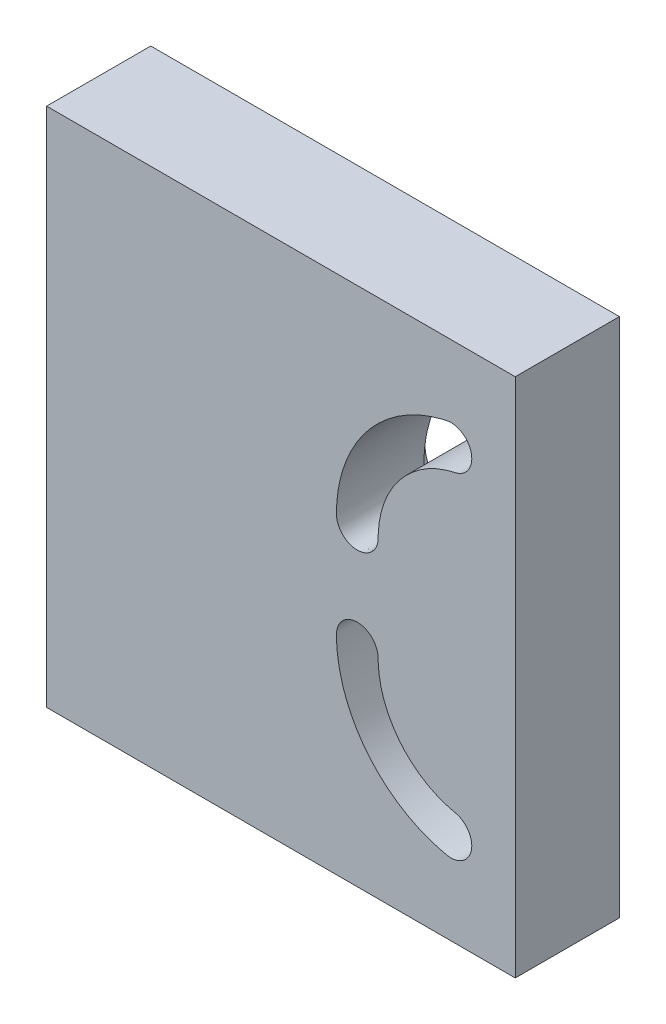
from build123d import *

# Parameters (mm, degrees)
SZKIC1_W                    = 90
SZKIC1_H                    = 50
DODANIE_WYCI_GNI_CIE1_DEPTH = 20
WYTNIJ_WYCI_GNI_CIE1_DEPTH  = 71.178344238
WYTNIJ_WYCI_GNI_CIE2_DEPTH  = 3.2


with BuildPart() as part:
    # Szkic1 → Dodanie-wyci_gni_cie1 (new body)
    with BuildSketch(Plane.XY):
        with Locations((0, 25)):
            Rectangle(SZKIC1_W, SZKIC1_H)
    extrude(amount=DODANIE_WYCI_GNI_CIE1_DEPTH)

    # Szkic2 → Wytnij-wyci_gni_cie1 (cut, through all)
    with BuildSketch(Plane.XY.offset(20)):
        with BuildLine():
            add(Edge.make_bspline(
                [(33.469603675, 28.288801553), (24.467928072, 26.369253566), (18.675621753, 19.216350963), (18.66957409, 10.012287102), (18.669572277, 10.009527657), (18.669569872, 10.004008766), (18.66957063, 9.995730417), (18.669559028, 9.990211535), (18.669550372, 9.987452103), (18.644597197, 2.032955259), (10.690061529, 2.035192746), (10.669583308, 9.989702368), (10.669577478, 9.991966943), (10.669569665, 9.996496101), (10.669569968, 10.003289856), (10.669571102, 10.007819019), (10.669571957, 10.010083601), (10.674537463, 23.158065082), (18.948830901, 33.37596652), (31.808465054, 36.114442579), (31.810679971, 36.114914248), (31.815109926, 36.115857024), (31.821755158, 36.117269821), (31.826186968, 36.118203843), (31.828403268, 36.118668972), (39.613345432, 37.752473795), (41.269374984, 29.972229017), (33.493891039, 28.293988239), (33.491193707, 28.293406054), (33.485797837, 28.292247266), (33.477700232, 28.290526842), (33.472302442, 28.289377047), (33.469603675, 28.288801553)],
                knots=[0, 0, 0, 0, 0.321286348, 0.321286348, 0.321286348, 0.321399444, 0.321512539, 0.321625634, 0.321625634, 0.321625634, 0.430917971, 0.430917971, 0.430917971, 0.431010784, 0.431103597, 0.431196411, 0.431196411, 0.431196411, 0.890089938, 0.890089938, 0.890089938, 0.890182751, 0.890275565, 0.890368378, 0.890368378, 0.890368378, 0.999660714, 0.999660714, 0.999660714, 0.999773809, 0.999886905, 1, 1, 1, 1], degree=3, weights=[1, 0.851706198, 0.851706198, 1, 1, 1, 1, 1, 1, 0.335237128, 0.335237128, 1, 1, 1, 1, 1, 1, 0.851589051, 0.851589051, 1, 1, 1, 1, 1, 1, 0.335237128, 0.335237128, 1, 1, 1, 1, 1, 1]))
        make_face()
    extrude(amount=-WYTNIJ_WYCI_GNI_CIE1_DEPTH, mode=Mode.SUBTRACT)

    # Szkic6 → Wytnij-wyci_gni_cie2 (cut)
    with BuildSketch(Plane(origin=(0, 0, 0), x_dir=(-1, 0, 0), z_dir=(0, 0, -1))):
        with BuildLine():
            add(Edge.make_bspline(
                [(-7.669572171, 10.01121659), (-7.670404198, 12.214311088), (-7.913343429, 14.376079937), (-8.627054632, 17.559110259), (-8.923709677, 18.610092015), (-9.638769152, 20.69127394), (-10.052242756, 21.706315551), (-11.447146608, 24.657924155), (-12.584174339, 26.510792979), (-14.272179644, 28.678933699), (-14.622710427, 29.104187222), (-15.34207116, 29.929347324), (-15.711881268, 30.33053953), (-16.851204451, 31.50051063), (-17.650522, 32.235783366), (-19.328255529, 33.617406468), (-20.206665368, 34.263763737), (-21.585458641, 35.164522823), (-22.055628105, 35.453355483), (-23.004732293, 36.000799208), (-23.485089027, 36.260384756), (-25.915389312, 37.488864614), (-27.949850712, 38.251928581), (-30.342264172, 38.857965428), (-30.609593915, 38.92176598), (-31.147005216, 39.042133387), (-31.415914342, 39.099722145), (-32.22734609, 39.212493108), (-32.77323648, 39.224725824), (-33.87529871, 39.118070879), (-34.408510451, 39.00139893), (-35.440622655, 38.646778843), (-35.944433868, 38.404380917), (-36.86700279, 37.817814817), (-37.29265158, 37.471875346), (-38.061853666, 36.677991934), (-38.392905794, 36.243545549), (-38.811474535, 35.537239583), (-38.938494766, 35.29110644), (-39.161826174, 34.786934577), (-39.257702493, 34.530417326), (-39.418807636, 34.008781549), (-39.484034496, 33.743662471), (-39.583483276, 33.204722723), (-39.617754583, 32.929032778), (-39.67087763, 32.105328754), (-39.64189629, 31.560303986), (-39.502572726, 30.74888624), (-39.439413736, 30.477989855), (-39.283323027, 29.951370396), (-39.097386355, 29.437409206), (-38.852893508, 28.948282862), (-38.578466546, 28.471852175), (-38.425686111, 28.239566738), (-37.933996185, 27.580116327), (-37.55897715, 27.183473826), (-36.924630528, 26.653888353), (-36.70150979, 26.489054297), (-36.242716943, 26.190035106), (-36.005689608, 26.054663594), (-35.271908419, 25.690604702), (-34.750713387, 25.503097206), (-34.067157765, 25.347475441), (-33.929292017, 25.319076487), (-33.656533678, 25.255260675), (-33.520896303, 25.221601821), (-33.116181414, 25.11543885), (-32.849299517, 25.037752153), (-32.057273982, 24.784344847), (-31.540726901, 24.588332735), (-30.025080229, 23.920054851), (-29.058546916, 23.36781825), (-27.226625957, 22.037124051), (-26.398189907, 21.285763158), (-25.281930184, 20.03450898), (-24.931092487, 19.596542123), (-24.273338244, 18.67744532), (-23.969988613, 18.2008916), (-23.14487351, 16.73807328), (-22.70225044, 15.712362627), (-22.202927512, 14.096436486), (-22.06495047, 13.54596817), (-21.850741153, 12.443608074), (-21.773516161, 11.88873739), (-21.702275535, 11.050922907), (-21.685977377, 10.770731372), (-21.672820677, 10.3490495), (-21.67031789, 10.208256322), (-21.669110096, 9.926200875), (-21.667684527, 9.785274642), (-21.646326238, 9.364605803), (-21.615126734, 9.085268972), (-21.520555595, 8.536617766), (-21.394096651, 7.99777173), (-21.20539452, 7.478064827), (-20.985007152, 6.968100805), (-20.858112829, 6.716849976), (-20.438758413, 5.996875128), (-20.106423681, 5.555824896), (-19.528185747, 4.953083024), (-19.321806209, 4.76229628), (-18.893056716, 4.410813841), (-18.669411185, 4.248689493), (-18.203773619, 3.951388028), (-17.961782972, 3.816208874), (-17.458864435, 3.573665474), (-17.199947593, 3.467481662), (-16.414424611, 3.198389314), (-15.874037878, 3.081694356), (-14.758658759, 2.978194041), (-14.20582564, 2.993481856), (-13.384297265, 3.113443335), (-13.110400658, 3.170141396), (-12.57130571, 3.316044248), (-12.308537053, 3.404408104), (-11.79612454, 3.610976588), (-11.546481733, 3.729183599), (-11.06045476, 3.995742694), (-10.822554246, 4.145256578), (-10.143139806, 4.631421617), (-9.735339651, 5.003821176), (-9.190774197, 5.634234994), (-9.019817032, 5.857841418), (-8.70930605, 6.31863498), (-8.428190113, 6.794795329), (-8.204779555, 7.301122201), (-8.010916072, 7.822895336), (-7.928948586, 8.091848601), (-7.79904077, 8.631480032), (-7.750386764, 8.903854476), (-7.701671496, 9.316225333), (-7.689487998, 9.45431882), (-7.677369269, 9.662425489), (-7.674356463, 9.731955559), (-7.670405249, 9.871341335), (-7.66954617, 9.942369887), (-7.669572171, 10.01121659)],
                knots=[0, 0, 0, 0, 0.0625, 0.0625, 0.09375, 0.09375, 0.125, 0.125, 0.1875, 0.1875, 0.203125, 0.203125, 0.21875, 0.21875, 0.25, 0.25, 0.28125, 0.28125, 0.296875, 0.296875, 0.3125, 0.3125, 0.375, 0.375, 0.3828125, 0.3828125, 0.390625, 0.390625, 0.40625, 0.40625, 0.421875, 0.421875, 0.4375, 0.4375, 0.453125, 0.453125, 0.46875, 0.46875, 0.4765625, 0.4765625, 0.484375, 0.484375, 0.4921875, 0.4921875, 0.5, 0.5, 0.515625, 0.515625, 0.5234375, 0.5234375, 0.53125, 0.5390625, 0.5390625, 0.546875, 0.546875, 0.5625, 0.5625, 0.5703125, 0.5703125, 0.578125, 0.578125, 0.59375, 0.59375, 0.59765625, 0.59765625, 0.6015625, 0.6015625, 0.609375, 0.609375, 0.625, 0.625, 0.65625, 0.65625, 0.6875, 0.6875, 0.703125, 0.703125, 0.71875, 0.71875, 0.75, 0.75, 0.765625, 0.765625, 0.78125, 0.78125, 0.7890625, 0.7890625, 0.79296875, 0.79296875, 0.796875, 0.796875, 0.8046875, 0.8046875, 0.8125, 0.8203125, 0.8203125, 0.828125, 0.828125, 0.84375, 0.84375, 0.8515625, 0.8515625, 0.859375, 0.859375, 0.8671875, 0.8671875, 0.875, 0.875, 0.890625, 0.890625, 0.90625, 0.90625, 0.9140625, 0.9140625, 0.921875, 0.921875, 0.9296875, 0.9296875, 0.9375, 0.9375, 0.953125, 0.953125, 0.9609375, 0.9609375, 0.96875, 0.9765625, 0.9765625, 0.984375, 0.984375, 0.9921875, 0.9921875, 0.99609375, 0.99609375, 0.998046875, 0.998046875, 1, 1, 1, 1], degree=3))
        make_face()
    extrude(amount=-WYTNIJ_WYCI_GNI_CIE2_DEPTH, mode=Mode.SUBTRACT)

    # Lustro1: part across plane


with BuildPart() as part_1:
    add(part.part)
    add(part.part.mirror(Plane(origin=(-45, 0, 20), x_dir=(0, 0, 1), z_dir=(0, 1, 0))))


solid = part_1.part
